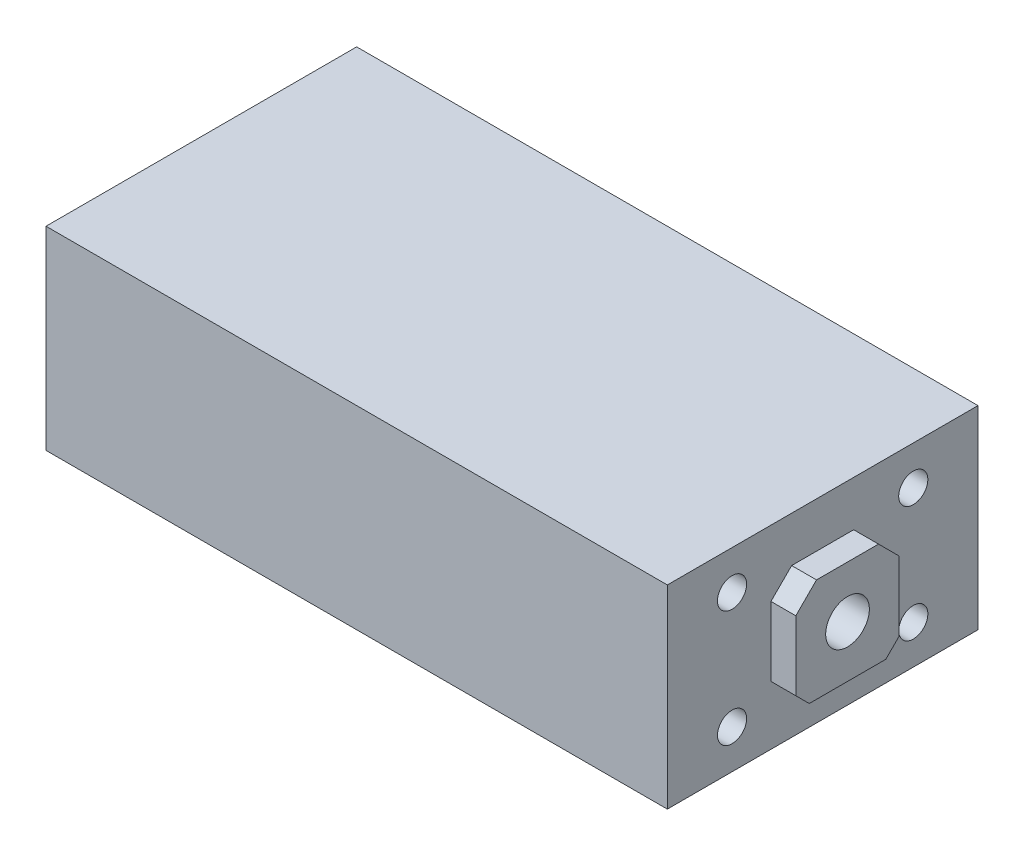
from build123d import *

# Parameters (mm, degrees)
SKETCH1_W                            = 76.2
SKETCH1_H                            = 47.625
BOSS_EXTRUDE1_DEPTH                  = 152.4
BOSS_EXTRUDE2_DEPTH                  = 6.096
F_9_32_0_28125_DIAMETER_HOLE1_D      = 7.14375
F_9_32_0_28125_DIAMETER_HOLE1_DEPTH  = 6.35
F_9_32_0_28125_DIAMETER_HOLE1_TIP    = 2.146199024
F_27_64_0_42188_DIAMETER_HOLE1_D     = 10.715752
F_27_64_0_42188_DIAMETER_HOLE1_DEPTH = 22.225
F_27_64_0_42188_DIAMETER_HOLE1_TIP   = 3.21933669


with BuildPart() as part:
    # Sketch1 → Boss-Extrude1 (new body)
    with BuildSketch(Plane(origin=(0, 0, 0), x_dir=(0, 0, -1), z_dir=(1, 0, 0))):
        Rectangle(SKETCH1_W, SKETCH1_H)
    extrude(amount=-BOSS_EXTRUDE1_DEPTH)

    # Sketch2 → Boss-Extrude2 (add)
    with BuildSketch(Plane(origin=(0, 0, 0), x_dir=(0, 0, -1), z_dir=(1, 0, 0))):
        Polygon((-12.68476, 0), (-12.68476, 7.60476), (-7.60476, 12.68476), (7.60476, 12.68476), (12.68476, 7.60476), (12.68476, 0), (12.68476, -9.38276), (9.38276, -12.68476), (-9.38276, -12.68476), (-12.68476, -9.38276), align=None)
    extrude(amount=BOSS_EXTRUDE2_DEPTH)

    # 9_32 _0.28125_ Diameter Hole1
    with Locations(Plane(origin=(0, 0, 0), x_dir=(0, 0, -1), z_dir=(1, 0, 0))):
        with Locations((-22.225, 14.2748), (-22.225, -14.2748), (22.225, -14.2748), (22.225, 14.2748)):
            Hole(F_9_32_0_28125_DIAMETER_HOLE1_D / 2, depth=F_9_32_0_28125_DIAMETER_HOLE1_DEPTH)
            with Locations((0, 0, -(F_9_32_0_28125_DIAMETER_HOLE1_DEPTH + F_9_32_0_28125_DIAMETER_HOLE1_TIP / 2))):  # 118° drill point
                Cone(0, F_9_32_0_28125_DIAMETER_HOLE1_D / 2, F_9_32_0_28125_DIAMETER_HOLE1_TIP, mode=Mode.SUBTRACT)

    # 27_64 _0.42188_ Diameter Hole1
    with Locations(Plane(origin=(6.096, 0, 0), x_dir=(0, 0, -1), z_dir=(1, 0, 0))):
        with Locations((0, 0)):
            Hole(F_27_64_0_42188_DIAMETER_HOLE1_D / 2, depth=F_27_64_0_42188_DIAMETER_HOLE1_DEPTH)
            with Locations((0, 0, -(F_27_64_0_42188_DIAMETER_HOLE1_DEPTH + F_27_64_0_42188_DIAMETER_HOLE1_TIP / 2))):  # 118° drill point
                Cone(0, F_27_64_0_42188_DIAMETER_HOLE1_D / 2, F_27_64_0_42188_DIAMETER_HOLE1_TIP, mode=Mode.SUBTRACT)


solid = part.part
